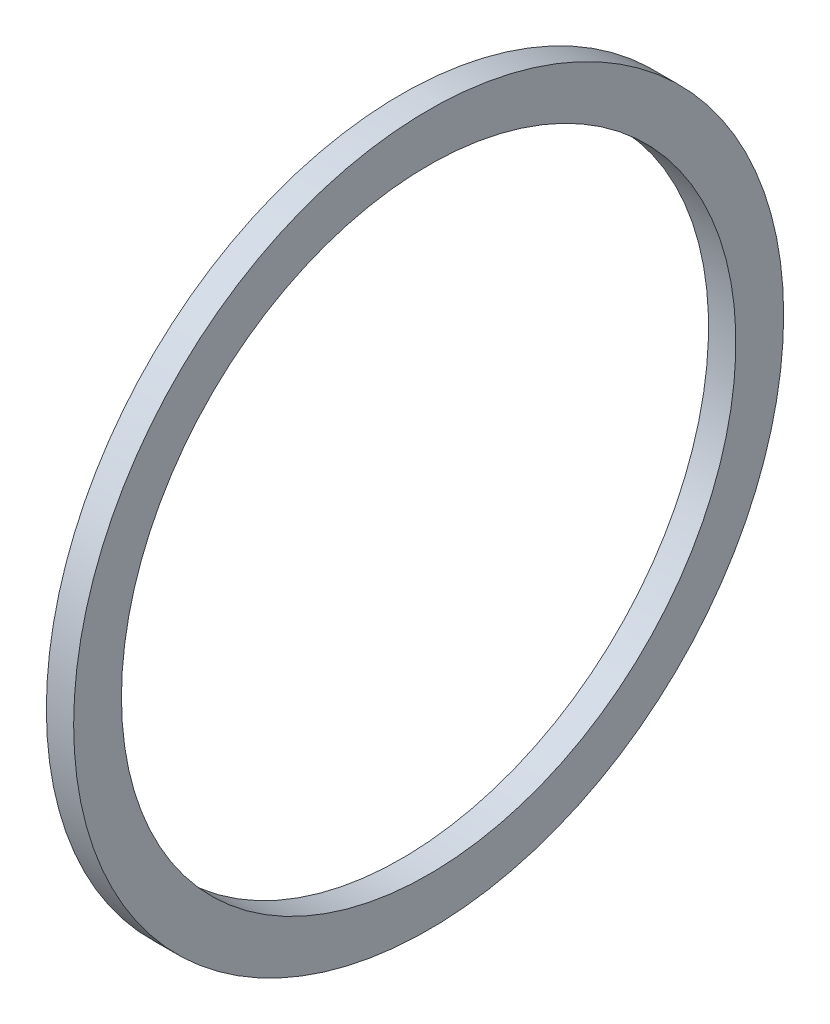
from build123d import *

# Parameters (mm, degrees)
ESQUISSE1_W = 2
ESQUISSE1_H = 3.5


with BuildPart() as part:
    # Esquisse1 → R_volution1 (revolve)
    with BuildSketch(Plane.XY, mode=Mode.PRIVATE) as r_volution1_sk:
        with Locations((17, 24.25)):
            Rectangle(ESQUISSE1_W, ESQUISSE1_H)
    revolve(r_volution1_sk.sketch.rotate(Axis((0, 0, 0), (1, 0, 0)), 90), axis=Axis((0, 0, 0), (1, 0, 0)))


solid = part.part
